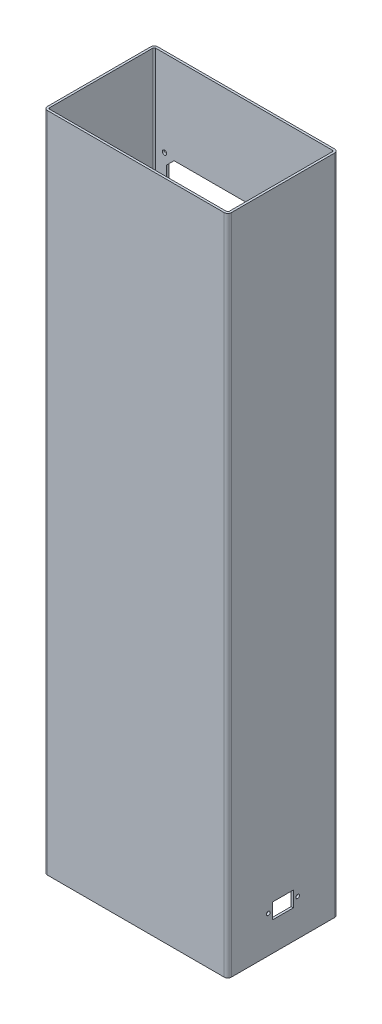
ISO-10303-21;
HEADER;
FILE_DESCRIPTION(('STEP AP214'),'2;1');
FILE_NAME('part.step','',(''),(''),'','','');
FILE_SCHEMA(('AUTOMOTIVE_DESIGN { 1 0 10303 214 1 1 1 1 }'));
ENDSEC;
DATA;
#1=APPLICATION_CONTEXT('core data for automotive mechanical design processes');
#2=APPLICATION_PROTOCOL_DEFINITION('international standard','automotive_design',2000,#1);
#3=PRODUCT_CONTEXT('',#1,'mechanical');
#4=PRODUCT('Part','Part','',(#3));
#5=PRODUCT_RELATED_PRODUCT_CATEGORY('part','',(#4));
#6=PRODUCT_DEFINITION_FORMATION('','',#4);
#7=PRODUCT_DEFINITION_CONTEXT('part definition',#1,'design');
#8=PRODUCT_DEFINITION('design','',#6,#7);
#9=PRODUCT_DEFINITION_SHAPE('','',#8);
#10=(LENGTH_UNIT() NAMED_UNIT(*) SI_UNIT(.MILLI.,.METRE.));
#11=(NAMED_UNIT(*) PLANE_ANGLE_UNIT() SI_UNIT($,.RADIAN.));
#12=(NAMED_UNIT(*) SI_UNIT($,.STERADIAN.) SOLID_ANGLE_UNIT());
#13=UNCERTAINTY_MEASURE_WITH_UNIT(LENGTH_MEASURE(1.E-05),#10,'distance_accuracy_value','');
#14=(GEOMETRIC_REPRESENTATION_CONTEXT(3) GLOBAL_UNCERTAINTY_ASSIGNED_CONTEXT((#13)) GLOBAL_UNIT_ASSIGNED_CONTEXT((#10,
#11,#12)) REPRESENTATION_CONTEXT('',''));
#15=CARTESIAN_POINT('',(0.,0.,0.));
#16=DIRECTION('',(0.,0.,1.));
#17=DIRECTION('',(1.,0.,0.));
#18=AXIS2_PLACEMENT_3D('',#15,#16,#17);
#19=CARTESIAN_POINT('',(1.59872115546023E-11,899.999999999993,-149.999999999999));
#20=DIRECTION('',(0.,-1.,0.));
#21=DIRECTION('',(0.,0.,-1.));
#22=AXIS2_PLACEMENT_3D('',#19,#20,#21);
#23=PLANE('',#22);
#24=DIRECTION('',(-1.,0.,0.));
#25=VECTOR('',#24,1.);
#26=CARTESIAN_POINT('',(1.59872115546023E-11,899.999999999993,-149.999999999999));
#27=LINE('',#26,#25);
#28=CARTESIAN_POINT('',(245.000000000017,899.999999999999,-149.999999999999));
#29=VERTEX_POINT('',#28);
#30=CARTESIAN_POINT('',(5.00000000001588,899.999999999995,-149.999999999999));
#31=VERTEX_POINT('',#30);
#32=EDGE_CURVE('E372',#29,#31,#27,.T.);
#33=ORIENTED_EDGE('',*,*,#32,.T.);
#34=CARTESIAN_POINT('',(5.00000000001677,899.999999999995,-144.999999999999));
#35=DIRECTION('',(0.,-1.,0.));
#36=DIRECTION('',(0.,0.,-1.));
#37=AXIS2_PLACEMENT_3D('',#34,#35,#36);
#38=CIRCLE('',#37,5.);
#39=CARTESIAN_POINT('',(1.68753899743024E-11,899.999999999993,-144.999999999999));
#40=VERTEX_POINT('',#39);
#41=EDGE_CURVE('E399',#31,#40,#38,.F.);
#42=ORIENTED_EDGE('',*,*,#41,.T.);
#43=DIRECTION('',(0.,0.,1.));
#44=VECTOR('',#43,1.);
#45=CARTESIAN_POINT('',(1.59872115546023E-11,899.999999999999,0.));
#46=LINE('',#45,#44);
#47=CARTESIAN_POINT('',(1.59872115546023E-11,899.999999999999,-4.99999999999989));
#48=VERTEX_POINT('',#47);
#49=EDGE_CURVE('E363',#40,#48,#46,.T.);
#50=ORIENTED_EDGE('',*,*,#49,.T.);
#51=CARTESIAN_POINT('',(5.00000000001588,900.000000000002,-4.99999999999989));
#52=DIRECTION('',(0.,-1.,0.));
#53=DIRECTION('',(0.,0.,-1.));
#54=AXIS2_PLACEMENT_3D('',#51,#52,#53);
#55=CIRCLE('',#54,5.);
#56=CARTESIAN_POINT('',(5.00000000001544,900.000000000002,0.));
#57=VERTEX_POINT('',#56);
#58=EDGE_CURVE('E397',#48,#57,#55,.F.);
#59=ORIENTED_EDGE('',*,*,#58,.T.);
#60=DIRECTION('',(1.,0.,0.));
#61=VECTOR('',#60,1.);
#62=CARTESIAN_POINT('',(1.59872115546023E-11,899.999999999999,0.));
#63=LINE('',#62,#61);
#64=CARTESIAN_POINT('',(245.000000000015,899.999999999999,0.));
#65=VERTEX_POINT('',#64);
#66=EDGE_CURVE('E366',#57,#65,#63,.T.);
#67=ORIENTED_EDGE('',*,*,#66,.T.);
#68=CARTESIAN_POINT('',(245.000000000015,899.999999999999,-4.99999999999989));
#69=DIRECTION('',(0.,-1.,0.));
#70=DIRECTION('',(0.,0.,-1.));
#71=AXIS2_PLACEMENT_3D('',#68,#69,#70);
#72=CIRCLE('',#71,5.);
#73=CARTESIAN_POINT('',(250.000000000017,900.,-4.99999999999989));
#74=VERTEX_POINT('',#73);
#75=EDGE_CURVE('E393',#65,#74,#72,.F.);
#76=ORIENTED_EDGE('',*,*,#75,.T.);
#77=DIRECTION('',(0.,0.,-1.));
#78=VECTOR('',#77,1.);
#79=CARTESIAN_POINT('',(250.000000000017,900.,6.66133814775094E-13));
#80=LINE('',#79,#78);
#81=CARTESIAN_POINT('',(250.000000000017,900.,-145.));
#82=VERTEX_POINT('',#81);
#83=EDGE_CURVE('E369',#74,#82,#80,.T.);
#84=ORIENTED_EDGE('',*,*,#83,.T.);
#85=CARTESIAN_POINT('',(245.000000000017,899.999999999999,-144.999999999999));
#86=DIRECTION('',(0.,-1.,0.));
#87=DIRECTION('',(0.,0.,-1.));
#88=AXIS2_PLACEMENT_3D('',#85,#86,#87);
#89=CIRCLE('',#88,5.);
#90=EDGE_CURVE('E395',#82,#29,#89,.F.);
#91=ORIENTED_EDGE('',*,*,#90,.T.);
#92=EDGE_LOOP('',(#33,#42,#50,#59,#67,#76,#84,#91));
#93=FACE_BOUND('',#92,.T.);
#94=DIRECTION('',(-1.,0.,0.));
#95=VECTOR('',#94,1.);
#96=CARTESIAN_POINT('',(1.68753899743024E-11,899.999999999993,-146.999999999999));
#97=LINE('',#96,#95);
#98=CARTESIAN_POINT('',(245.000000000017,899.999999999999,-146.999999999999));
#99=VERTEX_POINT('',#98);
#100=CARTESIAN_POINT('',(5.00000000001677,899.999999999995,-146.999999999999));
#101=VERTEX_POINT('',#100);
#102=EDGE_CURVE('E300',#99,#101,#97,.T.);
#103=ORIENTED_EDGE('',*,*,#102,.F.);
#104=CARTESIAN_POINT('',(245.000000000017,899.999999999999,-144.999999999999));
#105=DIRECTION('',(0.,-1.,0.));
#106=DIRECTION('',(0.,0.,-1.));
#107=AXIS2_PLACEMENT_3D('',#104,#105,#106);
#108=CIRCLE('',#107,2.);
#109=CARTESIAN_POINT('',(247.000000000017,900.000000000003,-144.999999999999));
#110=VERTEX_POINT('',#109);
#111=EDGE_CURVE('E326',#110,#99,#108,.F.);
#112=ORIENTED_EDGE('',*,*,#111,.F.);
#113=DIRECTION('',(0.,0.,-1.));
#114=VECTOR('',#113,1.);
#115=CARTESIAN_POINT('',(247.000000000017,900.000000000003,-149.999999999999));
#116=LINE('',#115,#114);
#117=CARTESIAN_POINT('',(247.000000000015,900.000000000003,-4.99999999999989));
#118=VERTEX_POINT('',#117);
#119=EDGE_CURVE('E329',#118,#110,#116,.T.);
#120=ORIENTED_EDGE('',*,*,#119,.F.);
#121=CARTESIAN_POINT('',(245.000000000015,899.999999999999,-4.99999999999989));
#122=DIRECTION('',(0.,-1.,0.));
#123=DIRECTION('',(0.,0.,-1.));
#124=AXIS2_PLACEMENT_3D('',#121,#122,#123);
#125=CIRCLE('',#124,2.);
#126=CARTESIAN_POINT('',(245.000000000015,899.999999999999,-3.00000000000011));
#127=VERTEX_POINT('',#126);
#128=EDGE_CURVE('E303',#127,#118,#125,.F.);
#129=ORIENTED_EDGE('',*,*,#128,.F.);
#130=DIRECTION('',(1.,0.,0.));
#131=VECTOR('',#130,1.);
#132=CARTESIAN_POINT('',(1.59872115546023E-11,899.999999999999,-3.00000000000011));
#133=LINE('',#132,#131);
#134=CARTESIAN_POINT('',(5.00000000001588,900.000000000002,-3.00000000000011));
#135=VERTEX_POINT('',#134);
#136=EDGE_CURVE('E322',#135,#127,#133,.T.);
#137=ORIENTED_EDGE('',*,*,#136,.F.);
#138=CARTESIAN_POINT('',(5.00000000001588,900.000000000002,-4.99999999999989));
#139=DIRECTION('',(0.,-1.,0.));
#140=DIRECTION('',(0.,0.,-1.));
#141=AXIS2_PLACEMENT_3D('',#138,#139,#140);
#142=CIRCLE('',#141,2.);
#143=CARTESIAN_POINT('',(3.00000000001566,899.999999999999,-4.99999999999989));
#144=VERTEX_POINT('',#143);
#145=EDGE_CURVE('E324',#144,#135,#142,.F.);
#146=ORIENTED_EDGE('',*,*,#145,.F.);
#147=DIRECTION('',(0.,0.,1.));
#148=VECTOR('',#147,1.);
#149=CARTESIAN_POINT('',(3.00000000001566,899.999999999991,-149.999999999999));
#150=LINE('',#149,#148);
#151=CARTESIAN_POINT('',(3.00000000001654,899.999999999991,-144.999999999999));
#152=VERTEX_POINT('',#151);
#153=EDGE_CURVE('E319',#152,#144,#150,.T.);
#154=ORIENTED_EDGE('',*,*,#153,.F.);
#155=CARTESIAN_POINT('',(5.00000000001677,899.999999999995,-144.999999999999));
#156=DIRECTION('',(0.,-1.,0.));
#157=DIRECTION('',(0.,0.,-1.));
#158=AXIS2_PLACEMENT_3D('',#155,#156,#157);
#159=CIRCLE('',#158,2.);
#160=EDGE_CURVE('E316',#101,#152,#159,.F.);
#161=ORIENTED_EDGE('',*,*,#160,.F.);
#162=EDGE_LOOP('',(#103,#112,#120,#129,#137,#146,#154,#161));
#163=FACE_BOUND('',#162,.T.);
#164=ADVANCED_FACE('F24',(#93,#163),#23,.F.);
#165=CARTESIAN_POINT('',(2.22044604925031E-12,0.,-149.999999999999));
#166=DIRECTION('',(0.,-1.,0.));
#167=DIRECTION('',(0.,0.,-1.));
#168=AXIS2_PLACEMENT_3D('',#165,#166,#167);
#169=PLANE('',#168);
#170=DIRECTION('',(0.,0.,1.));
#171=VECTOR('',#170,1.);
#172=CARTESIAN_POINT('',(0.,2.22044604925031E-13,0.));
#173=LINE('',#172,#171);
#174=CARTESIAN_POINT('',(-1.77635683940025E-12,0.,-144.999999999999));
#175=VERTEX_POINT('',#174);
#176=CARTESIAN_POINT('',(-8.88178419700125E-13,2.22044604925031E-13,-4.99999999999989));
#177=VERTEX_POINT('',#176);
#178=EDGE_CURVE('E310',#175,#177,#173,.T.);
#179=ORIENTED_EDGE('',*,*,#178,.F.);
#180=CARTESIAN_POINT('',(4.99999999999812,2.66453525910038E-12,-144.999999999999));
#181=DIRECTION('',(0.,-1.,0.));
#182=DIRECTION('',(0.,0.,-1.));
#183=AXIS2_PLACEMENT_3D('',#180,#181,#182);
#184=CIRCLE('',#183,5.);
#185=CARTESIAN_POINT('',(5.00000000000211,2.66453525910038E-12,-149.999999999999));
#186=VERTEX_POINT('',#185);
#187=EDGE_CURVE('E386',#175,#186,#184,.T.);
#188=ORIENTED_EDGE('',*,*,#187,.T.);
#189=DIRECTION('',(-1.,0.,0.));
#190=VECTOR('',#189,1.);
#191=CARTESIAN_POINT('',(2.22044604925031E-12,0.,-149.999999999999));
#192=LINE('',#191,#190);
#193=CARTESIAN_POINT('',(245.000000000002,-5.55111512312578E-13,-149.999999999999));
#194=VERTEX_POINT('',#193);
#195=EDGE_CURVE('E360',#194,#186,#192,.T.);
#196=ORIENTED_EDGE('',*,*,#195,.F.);
#197=CARTESIAN_POINT('',(244.999999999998,-5.55111512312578E-13,-144.999999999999));
#198=DIRECTION('',(0.,-1.,0.));
#199=DIRECTION('',(0.,0.,-1.));
#200=AXIS2_PLACEMENT_3D('',#197,#198,#199);
#201=CIRCLE('',#200,5.);
#202=CARTESIAN_POINT('',(249.999999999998,3.33066907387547E-13,-145.));
#203=VERTEX_POINT('',#202);
#204=EDGE_CURVE('E382',#194,#203,#201,.T.);
#205=ORIENTED_EDGE('',*,*,#204,.T.);
#206=DIRECTION('',(0.,0.,-1.));
#207=VECTOR('',#206,1.);
#208=CARTESIAN_POINT('',(250.,5.55111512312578E-13,4.44089209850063E-13));
#209=LINE('',#208,#207);
#210=CARTESIAN_POINT('',(249.999999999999,5.55111512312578E-13,-4.99999999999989));
#211=VERTEX_POINT('',#210);
#212=EDGE_CURVE('E357',#211,#203,#209,.T.);
#213=ORIENTED_EDGE('',*,*,#212,.F.);
#214=CARTESIAN_POINT('',(244.999999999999,-5.55111512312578E-13,-4.99999999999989));
#215=DIRECTION('',(0.,-1.,0.));
#216=DIRECTION('',(0.,0.,-1.));
#217=AXIS2_PLACEMENT_3D('',#214,#215,#216);
#218=CIRCLE('',#217,5.);
#219=CARTESIAN_POINT('',(245.,-5.55111512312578E-13,0.));
#220=VERTEX_POINT('',#219);
#221=EDGE_CURVE('E380',#211,#220,#218,.T.);
#222=ORIENTED_EDGE('',*,*,#221,.T.);
#223=DIRECTION('',(1.,0.,0.));
#224=VECTOR('',#223,1.);
#225=CARTESIAN_POINT('',(0.,2.22044604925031E-13,0.));
#226=LINE('',#225,#224);
#227=CARTESIAN_POINT('',(4.99999999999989,2.66453525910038E-12,0.));
#228=VERTEX_POINT('',#227);
#229=EDGE_CURVE('E354',#228,#220,#226,.T.);
#230=ORIENTED_EDGE('',*,*,#229,.F.);
#231=CARTESIAN_POINT('',(4.99999999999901,2.66453525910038E-12,-4.99999999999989));
#232=DIRECTION('',(0.,-1.,0.));
#233=DIRECTION('',(0.,0.,-1.));
#234=AXIS2_PLACEMENT_3D('',#231,#232,#233);
#235=CIRCLE('',#234,5.);
#236=EDGE_CURVE('E384',#228,#177,#235,.T.);
#237=ORIENTED_EDGE('',*,*,#236,.T.);
#238=EDGE_LOOP('',(#179,#188,#196,#205,#213,#222,#230,#237));
#239=FACE_BOUND('',#238,.T.);
#240=CARTESIAN_POINT('',(4.99999999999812,2.66453525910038E-12,-144.999999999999));
#241=DIRECTION('',(0.,-1.,0.));
#242=DIRECTION('',(0.,0.,-1.));
#243=AXIS2_PLACEMENT_3D('',#240,#241,#242);
#244=CIRCLE('',#243,2.);
#245=CARTESIAN_POINT('',(2.99999999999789,-9.57567358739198E-13,-144.999999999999));
#246=VERTEX_POINT('',#245);
#247=CARTESIAN_POINT('',(4.99999999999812,2.66453525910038E-12,-146.999999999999));
#248=VERTEX_POINT('',#247);
#249=EDGE_CURVE('E306',#246,#248,#244,.T.);
#250=ORIENTED_EDGE('',*,*,#249,.F.);
#251=DIRECTION('',(0.,0.,1.));
#252=VECTOR('',#251,1.);
#253=CARTESIAN_POINT('',(3.00000000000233,-9.57567358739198E-13,-149.999999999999));
#254=LINE('',#253,#252);
#255=CARTESIAN_POINT('',(2.99999999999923,-9.57567358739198E-13,-4.99999999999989));
#256=VERTEX_POINT('',#255);
#257=EDGE_CURVE('E280',#246,#256,#254,.T.);
#258=ORIENTED_EDGE('',*,*,#257,.T.);
#259=CARTESIAN_POINT('',(4.99999999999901,2.66453525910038E-12,-4.99999999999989));
#260=DIRECTION('',(0.,-1.,0.));
#261=DIRECTION('',(0.,0.,-1.));
#262=AXIS2_PLACEMENT_3D('',#259,#260,#261);
#263=CIRCLE('',#262,2.);
#264=CARTESIAN_POINT('',(5.00000000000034,2.66453525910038E-12,-3.00000000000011));
#265=VERTEX_POINT('',#264);
#266=EDGE_CURVE('E340',#265,#256,#263,.T.);
#267=ORIENTED_EDGE('',*,*,#266,.F.);
#268=DIRECTION('',(1.,0.,0.));
#269=VECTOR('',#268,1.);
#270=CARTESIAN_POINT('',(0.,2.22044604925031E-13,-3.00000000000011));
#271=LINE('',#270,#269);
#272=CARTESIAN_POINT('',(245.,-5.55111512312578E-13,-3.00000000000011));
#273=VERTEX_POINT('',#272);
#274=EDGE_CURVE('E338',#265,#273,#271,.T.);
#275=ORIENTED_EDGE('',*,*,#274,.T.);
#276=CARTESIAN_POINT('',(244.999999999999,-5.55111512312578E-13,-4.99999999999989));
#277=DIRECTION('',(0.,-1.,0.));
#278=DIRECTION('',(0.,0.,-1.));
#279=AXIS2_PLACEMENT_3D('',#276,#277,#278);
#280=CIRCLE('',#279,2.);
#281=CARTESIAN_POINT('',(246.999999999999,3.01147995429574E-12,-4.99999999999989));
#282=VERTEX_POINT('',#281);
#283=EDGE_CURVE('E297',#282,#273,#280,.T.);
#284=ORIENTED_EDGE('',*,*,#283,.F.);
#285=DIRECTION('',(0.,0.,-1.));
#286=VECTOR('',#285,1.);
#287=CARTESIAN_POINT('',(247.000000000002,3.01147995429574E-12,-149.999999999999));
#288=LINE('',#287,#286);
#289=CARTESIAN_POINT('',(246.999999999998,3.01147995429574E-12,-144.999999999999));
#290=VERTEX_POINT('',#289);
#291=EDGE_CURVE('E343',#282,#290,#288,.T.);
#292=ORIENTED_EDGE('',*,*,#291,.T.);
#293=CARTESIAN_POINT('',(244.999999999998,-5.55111512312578E-13,-144.999999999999));
#294=DIRECTION('',(0.,-1.,0.));
#295=DIRECTION('',(0.,0.,-1.));
#296=AXIS2_PLACEMENT_3D('',#293,#294,#295);
#297=CIRCLE('',#296,2.);
#298=CARTESIAN_POINT('',(244.999999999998,-5.55111512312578E-13,-146.999999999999));
#299=VERTEX_POINT('',#298);
#300=EDGE_CURVE('E344',#299,#290,#297,.T.);
#301=ORIENTED_EDGE('',*,*,#300,.F.);
#302=DIRECTION('',(-1.,0.,0.));
#303=VECTOR('',#302,1.);
#304=CARTESIAN_POINT('',(-2.22044604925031E-12,0.,-146.999999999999));
#305=LINE('',#304,#303);
#306=EDGE_CURVE('E323',#299,#248,#305,.T.);
#307=ORIENTED_EDGE('',*,*,#306,.T.);
#308=EDGE_LOOP('',(#250,#258,#267,#275,#284,#292,#301,#307));
#309=FACE_BOUND('',#308,.T.);
#310=ADVANCED_FACE('F470',(#239,#309),#169,.T.);
#311=CARTESIAN_POINT('',(1.59872115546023E-11,899.999999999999,0.));
#312=DIRECTION('',(1.,0.,0.));
#313=DIRECTION('',(0.,0.,-1.));
#314=AXIS2_PLACEMENT_3D('',#311,#312,#313);
#315=PLANE('',#314);
#316=ORIENTED_EDGE('',*,*,#49,.F.);
#317=DIRECTION('',(0.,-1.,0.));
#318=VECTOR('',#317,1.);
#319=CARTESIAN_POINT('',(1.68753899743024E-11,899.999999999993,-144.999999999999));
#320=LINE('',#319,#318);
#321=EDGE_CURVE('E377',#40,#175,#320,.T.);
#322=ORIENTED_EDGE('',*,*,#321,.T.);
#323=ORIENTED_EDGE('',*,*,#178,.T.);
#324=DIRECTION('',(0.,-1.,0.));
#325=VECTOR('',#324,1.);
#326=CARTESIAN_POINT('',(1.59872115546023E-11,899.999999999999,-4.99999999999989));
#327=LINE('',#326,#325);
#328=EDGE_CURVE('E375',#177,#48,#327,.F.);
#329=ORIENTED_EDGE('',*,*,#328,.T.);
#330=EDGE_LOOP('',(#316,#322,#323,#329));
#331=FACE_BOUND('',#330,.T.);
#332=ADVANCED_FACE('F26',(#331),#315,.F.);
#333=CARTESIAN_POINT('',(1.59872115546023E-11,899.999999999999,0.));
#334=DIRECTION('',(0.,0.,-1.));
#335=DIRECTION('',(-1.,0.,0.));
#336=AXIS2_PLACEMENT_3D('',#333,#334,#335);
#337=PLANE('',#336);
#338=ORIENTED_EDGE('',*,*,#66,.F.);
#339=DIRECTION('',(0.,-1.,0.));
#340=VECTOR('',#339,1.);
#341=CARTESIAN_POINT('',(5.00000000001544,900.000000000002,0.));
#342=LINE('',#341,#340);
#343=EDGE_CURVE('E403',#57,#228,#342,.T.);
#344=ORIENTED_EDGE('',*,*,#343,.T.);
#345=ORIENTED_EDGE('',*,*,#229,.T.);
#346=DIRECTION('',(0.,-1.,0.));
#347=VECTOR('',#346,1.);
#348=CARTESIAN_POINT('',(245.000000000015,899.999999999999,0.));
#349=LINE('',#348,#347);
#350=EDGE_CURVE('E401',#220,#65,#349,.F.);
#351=ORIENTED_EDGE('',*,*,#350,.T.);
#352=EDGE_LOOP('',(#338,#344,#345,#351));
#353=FACE_BOUND('',#352,.T.);
#354=ADVANCED_FACE('F459',(#353),#337,.F.);
#355=CARTESIAN_POINT('',(250.000000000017,900.,6.66133814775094E-13));
#356=DIRECTION('',(-1.,0.,0.));
#357=DIRECTION('',(0.,0.,1.));
#358=AXIS2_PLACEMENT_3D('',#355,#356,#357);
#359=PLANE('',#358);
#360=CARTESIAN_POINT('',(250.00000000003,50.0000000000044,-54.9999999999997));
#361=DIRECTION('',(1.,0.,0.));
#362=DIRECTION('',(0.,1.,0.));
#363=AXIS2_PLACEMENT_3D('',#360,#361,#362);
#364=CIRCLE('',#363,2.5);
#365=CARTESIAN_POINT('',(250.00000000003,52.5000000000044,-54.9999999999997));
#366=VERTEX_POINT('',#365);
#367=EDGE_CURVE('E449',#366,#366,#364,.T.);
#368=ORIENTED_EDGE('',*,*,#367,.F.);
#369=EDGE_LOOP('',(#368));
#370=FACE_BOUND('',#369,.T.);
#371=CARTESIAN_POINT('',(250.00000000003,50.0000000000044,-94.9999999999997));
#372=DIRECTION('',(1.,0.,0.));
#373=DIRECTION('',(0.,1.,0.));
#374=AXIS2_PLACEMENT_3D('',#371,#372,#373);
#375=CIRCLE('',#374,2.49999999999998);
#376=CARTESIAN_POINT('',(250.00000000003,52.5000000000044,-94.9999999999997));
#377=VERTEX_POINT('',#376);
#378=EDGE_CURVE('E441',#377,#377,#375,.T.);
#379=ORIENTED_EDGE('',*,*,#378,.F.);
#380=EDGE_LOOP('',(#379));
#381=FACE_BOUND('',#380,.T.);
#382=DIRECTION('',(0.,0.,-1.));
#383=VECTOR('',#382,1.);
#384=CARTESIAN_POINT('',(250.000000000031,39.5000000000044,-60.9999999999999));
#385=LINE('',#384,#383);
#386=CARTESIAN_POINT('',(250.000000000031,39.5000000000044,-60.9999999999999));
#387=VERTEX_POINT('',#386);
#388=CARTESIAN_POINT('',(250.000000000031,39.5000000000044,-88.9999999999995));
#389=VERTEX_POINT('',#388);
#390=EDGE_CURVE('E222',#387,#389,#385,.T.);
#391=ORIENTED_EDGE('',*,*,#390,.F.);
#392=DIRECTION('',(0.,-1.,0.));
#393=VECTOR('',#392,1.);
#394=CARTESIAN_POINT('',(250.00000000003,60.5000000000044,-60.9999999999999));
#395=LINE('',#394,#393);
#396=CARTESIAN_POINT('',(250.00000000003,60.5000000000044,-60.9999999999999));
#397=VERTEX_POINT('',#396);
#398=EDGE_CURVE('E41',#397,#387,#395,.T.);
#399=ORIENTED_EDGE('',*,*,#398,.F.);
#400=DIRECTION('',(0.,0.,1.));
#401=VECTOR('',#400,1.);
#402=CARTESIAN_POINT('',(250.00000000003,60.5000000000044,-60.9999999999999));
#403=LINE('',#402,#401);
#404=CARTESIAN_POINT('',(250.000000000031,60.5000000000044,-88.9999999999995));
#405=VERTEX_POINT('',#404);
#406=EDGE_CURVE('E229',#405,#397,#403,.T.);
#407=ORIENTED_EDGE('',*,*,#406,.F.);
#408=DIRECTION('',(0.,1.,0.));
#409=VECTOR('',#408,1.);
#410=CARTESIAN_POINT('',(250.000000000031,60.5000000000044,-88.9999999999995));
#411=LINE('',#410,#409);
#412=EDGE_CURVE('E213',#389,#405,#411,.T.);
#413=ORIENTED_EDGE('',*,*,#412,.F.);
#414=EDGE_LOOP('',(#391,#399,#407,#413));
#415=FACE_BOUND('',#414,.T.);
#416=ORIENTED_EDGE('',*,*,#212,.T.);
#417=DIRECTION('',(0.,-1.,0.));
#418=VECTOR('',#417,1.);
#419=CARTESIAN_POINT('',(250.000000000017,900.,-145.));
#420=LINE('',#419,#418);
#421=EDGE_CURVE('E409',#203,#82,#420,.F.);
#422=ORIENTED_EDGE('',*,*,#421,.T.);
#423=ORIENTED_EDGE('',*,*,#83,.F.);
#424=DIRECTION('',(0.,-1.,0.));
#425=VECTOR('',#424,1.);
#426=CARTESIAN_POINT('',(250.000000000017,900.,-4.99999999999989));
#427=LINE('',#426,#425);
#428=EDGE_CURVE('E406',#74,#211,#427,.T.);
#429=ORIENTED_EDGE('',*,*,#428,.T.);
#430=EDGE_LOOP('',(#416,#422,#423,#429));
#431=FACE_BOUND('',#430,.T.);
#432=ADVANCED_FACE('F226',(#370,#381,#415,#431),#359,.F.);
#433=CARTESIAN_POINT('',(1.59872115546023E-11,899.999999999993,-149.999999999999));
#434=DIRECTION('',(0.,0.,1.));
#435=DIRECTION('',(1.,0.,0.));
#436=AXIS2_PLACEMENT_3D('',#433,#434,#435);
#437=PLANE('',#436);
#438=CARTESIAN_POINT('',(233.,447.,-149.999999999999));
#439=DIRECTION('',(0.,0.,-1.));
#440=DIRECTION('',(0.,1.,0.));
#441=AXIS2_PLACEMENT_3D('',#438,#439,#440);
#442=CIRCLE('',#441,2.99999999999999);
#443=CARTESIAN_POINT('',(233.,450.,-149.999999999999));
#444=VERTEX_POINT('',#443);
#445=EDGE_CURVE('E236',#444,#444,#442,.T.);
#446=ORIENTED_EDGE('',*,*,#445,.F.);
#447=EDGE_LOOP('',(#446));
#448=FACE_BOUND('',#447,.T.);
#449=CARTESIAN_POINT('',(233.,783.,-149.999999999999));
#450=DIRECTION('',(0.,0.,-1.));
#451=DIRECTION('',(0.,1.,0.));
#452=AXIS2_PLACEMENT_3D('',#449,#450,#451);
#453=CIRCLE('',#452,2.99999999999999);
#454=CARTESIAN_POINT('',(233.,786.,-149.999999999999));
#455=VERTEX_POINT('',#454);
#456=EDGE_CURVE('E242',#455,#455,#453,.T.);
#457=ORIENTED_EDGE('',*,*,#456,.F.);
#458=EDGE_LOOP('',(#457));
#459=FACE_BOUND('',#458,.T.);
#460=CARTESIAN_POINT('',(17.0000000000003,447.,-149.999999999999));
#461=DIRECTION('',(0.,0.,-1.));
#462=DIRECTION('',(0.,1.,0.));
#463=AXIS2_PLACEMENT_3D('',#460,#461,#462);
#464=CIRCLE('',#463,3.);
#465=CARTESIAN_POINT('',(17.0000000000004,450.,-149.999999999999));
#466=VERTEX_POINT('',#465);
#467=EDGE_CURVE('E246',#466,#466,#464,.T.);
#468=ORIENTED_EDGE('',*,*,#467,.F.);
#469=EDGE_LOOP('',(#468));
#470=FACE_BOUND('',#469,.T.);
#471=CARTESIAN_POINT('',(17.0000000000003,783.000000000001,-149.999999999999));
#472=DIRECTION('',(0.,0.,-1.));
#473=DIRECTION('',(0.,1.,0.));
#474=AXIS2_PLACEMENT_3D('',#471,#472,#473);
#475=CIRCLE('',#474,3.);
#476=CARTESIAN_POINT('',(17.0000000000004,786.000000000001,-149.999999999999));
#477=VERTEX_POINT('',#476);
#478=EDGE_CURVE('E250',#477,#477,#475,.T.);
#479=ORIENTED_EDGE('',*,*,#478,.F.);
#480=EDGE_LOOP('',(#479));
#481=FACE_BOUND('',#480,.T.);
#482=DIRECTION('',(-0.707106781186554,-0.707106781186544,0.));
#483=VECTOR('',#482,1.);
#484=CARTESIAN_POINT('',(220.,450.,-149.999999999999));
#485=LINE('',#484,#483);
#486=CARTESIAN_POINT('',(230.000000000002,460.,-149.999999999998));
#487=VERTEX_POINT('',#486);
#488=CARTESIAN_POINT('',(220.,450.,-149.999999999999));
#489=VERTEX_POINT('',#488);
#490=EDGE_CURVE('E256',#487,#489,#485,.T.);
#491=ORIENTED_EDGE('',*,*,#490,.F.);
#492=DIRECTION('',(0.,-1.,0.));
#493=VECTOR('',#492,1.);
#494=CARTESIAN_POINT('',(230.,770.,-149.999999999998));
#495=LINE('',#494,#493);
#496=CARTESIAN_POINT('',(230.,770.,-149.999999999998));
#497=VERTEX_POINT('',#496);
#498=EDGE_CURVE('E254',#497,#487,#495,.T.);
#499=ORIENTED_EDGE('',*,*,#498,.F.);
#500=DIRECTION('',(0.707106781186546,-0.707106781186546,0.));
#501=VECTOR('',#500,1.);
#502=CARTESIAN_POINT('',(230.,770.,-149.999999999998));
#503=LINE('',#502,#501);
#504=CARTESIAN_POINT('',(220.,780.000000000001,-149.999999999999));
#505=VERTEX_POINT('',#504);
#506=EDGE_CURVE('E274',#505,#497,#503,.T.);
#507=ORIENTED_EDGE('',*,*,#506,.F.);
#508=DIRECTION('',(1.,0.,0.));
#509=VECTOR('',#508,1.);
#510=CARTESIAN_POINT('',(220.,780.000000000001,-149.999999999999));
#511=LINE('',#510,#509);
#512=CARTESIAN_POINT('',(30.0000000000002,780.,-149.999999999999));
#513=VERTEX_POINT('',#512);
#514=EDGE_CURVE('E271',#513,#505,#511,.T.);
#515=ORIENTED_EDGE('',*,*,#514,.F.);
#516=DIRECTION('',(0.707106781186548,0.70710678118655,0.));
#517=VECTOR('',#516,1.);
#518=CARTESIAN_POINT('',(30.0000000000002,780.,-149.999999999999));
#519=LINE('',#518,#517);
#520=CARTESIAN_POINT('',(20.0000000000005,770.,-150.));
#521=VERTEX_POINT('',#520);
#522=EDGE_CURVE('E268',#521,#513,#519,.T.);
#523=ORIENTED_EDGE('',*,*,#522,.F.);
#524=DIRECTION('',(0.,1.,0.));
#525=VECTOR('',#524,1.);
#526=CARTESIAN_POINT('',(20.0000000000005,770.,-150.));
#527=LINE('',#526,#525);
#528=CARTESIAN_POINT('',(20.0000000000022,460.,-150.));
#529=VERTEX_POINT('',#528);
#530=EDGE_CURVE('E265',#529,#521,#527,.T.);
#531=ORIENTED_EDGE('',*,*,#530,.F.);
#532=DIRECTION('',(-0.707106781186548,0.707106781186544,0.));
#533=VECTOR('',#532,1.);
#534=CARTESIAN_POINT('',(20.0000000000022,460.,-150.));
#535=LINE('',#534,#533);
#536=CARTESIAN_POINT('',(30.0000000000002,450.,-149.999999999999));
#537=VERTEX_POINT('',#536);
#538=EDGE_CURVE('E262',#537,#529,#535,.T.);
#539=ORIENTED_EDGE('',*,*,#538,.F.);
#540=DIRECTION('',(-1.,0.,0.));
#541=VECTOR('',#540,1.);
#542=CARTESIAN_POINT('',(220.,450.,-149.999999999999));
#543=LINE('',#542,#541);
#544=EDGE_CURVE('E259',#489,#537,#543,.T.);
#545=ORIENTED_EDGE('',*,*,#544,.F.);
#546=EDGE_LOOP('',(#491,#499,#507,#515,#523,#531,#539,#545));
#547=FACE_BOUND('',#546,.T.);
#548=ORIENTED_EDGE('',*,*,#195,.T.);
#549=DIRECTION('',(0.,-1.,0.));
#550=VECTOR('',#549,1.);
#551=CARTESIAN_POINT('',(5.00000000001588,899.999999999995,-149.999999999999));
#552=LINE('',#551,#550);
#553=EDGE_CURVE('E391',#186,#31,#552,.F.);
#554=ORIENTED_EDGE('',*,*,#553,.T.);
#555=ORIENTED_EDGE('',*,*,#32,.F.);
#556=DIRECTION('',(0.,-1.,0.));
#557=VECTOR('',#556,1.);
#558=CARTESIAN_POINT('',(245.000000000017,899.999999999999,-149.999999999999));
#559=LINE('',#558,#557);
#560=EDGE_CURVE('E388',#29,#194,#559,.T.);
#561=ORIENTED_EDGE('',*,*,#560,.T.);
#562=EDGE_LOOP('',(#548,#554,#555,#561));
#563=FACE_BOUND('',#562,.T.);
#564=ADVANCED_FACE('F458',(#448,#459,#470,#481,#547,#563),#437,.F.);
#565=CARTESIAN_POINT('',(5.00000000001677,899.999999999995,-144.999999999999));
#566=DIRECTION('',(0.,-1.,0.));
#567=DIRECTION('',(0.,0.,-1.));
#568=AXIS2_PLACEMENT_3D('',#565,#566,#567);
#569=CYLINDRICAL_SURFACE('',#568,5.);
#570=ORIENTED_EDGE('',*,*,#41,.F.);
#571=ORIENTED_EDGE('',*,*,#553,.F.);
#572=ORIENTED_EDGE('',*,*,#187,.F.);
#573=ORIENTED_EDGE('',*,*,#321,.F.);
#574=EDGE_LOOP('',(#570,#571,#572,#573));
#575=FACE_BOUND('',#574,.T.);
#576=ADVANCED_FACE('F465',(#575),#569,.T.);
#577=CARTESIAN_POINT('',(5.00000000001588,900.000000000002,-4.99999999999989));
#578=DIRECTION('',(0.,-1.,0.));
#579=DIRECTION('',(0.,0.,-1.));
#580=AXIS2_PLACEMENT_3D('',#577,#578,#579);
#581=CYLINDRICAL_SURFACE('',#580,5.);
#582=ORIENTED_EDGE('',*,*,#58,.F.);
#583=ORIENTED_EDGE('',*,*,#328,.F.);
#584=ORIENTED_EDGE('',*,*,#236,.F.);
#585=ORIENTED_EDGE('',*,*,#343,.F.);
#586=EDGE_LOOP('',(#582,#583,#584,#585));
#587=FACE_BOUND('',#586,.T.);
#588=ADVANCED_FACE('F482',(#587),#581,.T.);
#589=CARTESIAN_POINT('',(245.000000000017,899.999999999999,-144.999999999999));
#590=DIRECTION('',(0.,-1.,0.));
#591=DIRECTION('',(0.,0.,-1.));
#592=AXIS2_PLACEMENT_3D('',#589,#590,#591);
#593=CYLINDRICAL_SURFACE('',#592,5.);
#594=ORIENTED_EDGE('',*,*,#90,.F.);
#595=ORIENTED_EDGE('',*,*,#421,.F.);
#596=ORIENTED_EDGE('',*,*,#204,.F.);
#597=ORIENTED_EDGE('',*,*,#560,.F.);
#598=EDGE_LOOP('',(#594,#595,#596,#597));
#599=FACE_BOUND('',#598,.T.);
#600=ADVANCED_FACE('F486',(#599),#593,.T.);
#601=CARTESIAN_POINT('',(245.000000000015,899.999999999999,-4.99999999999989));
#602=DIRECTION('',(0.,-1.,0.));
#603=DIRECTION('',(0.,0.,-1.));
#604=AXIS2_PLACEMENT_3D('',#601,#602,#603);
#605=CYLINDRICAL_SURFACE('',#604,5.);
#606=ORIENTED_EDGE('',*,*,#75,.F.);
#607=ORIENTED_EDGE('',*,*,#350,.F.);
#608=ORIENTED_EDGE('',*,*,#221,.F.);
#609=ORIENTED_EDGE('',*,*,#428,.F.);
#610=EDGE_LOOP('',(#606,#607,#608,#609));
#611=FACE_BOUND('',#610,.T.);
#612=ADVANCED_FACE('F490',(#611),#605,.T.);
#613=CARTESIAN_POINT('',(3.00000000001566,899.999999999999,0.));
#614=DIRECTION('',(1.,0.,0.));
#615=DIRECTION('',(0.,0.,-1.));
#616=AXIS2_PLACEMENT_3D('',#613,#614,#615);
#617=PLANE('',#616);
#618=ORIENTED_EDGE('',*,*,#153,.T.);
#619=DIRECTION('',(0.,1.,0.));
#620=VECTOR('',#619,1.);
#621=CARTESIAN_POINT('',(3.00000000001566,899.999999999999,-4.99999999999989));
#622=LINE('',#621,#620);
#623=EDGE_CURVE('E298',#256,#144,#622,.T.);
#624=ORIENTED_EDGE('',*,*,#623,.F.);
#625=ORIENTED_EDGE('',*,*,#257,.F.);
#626=DIRECTION('',(0.,1.,0.));
#627=VECTOR('',#626,1.);
#628=CARTESIAN_POINT('',(3.00000000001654,899.999999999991,-144.999999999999));
#629=LINE('',#628,#627);
#630=EDGE_CURVE('E295',#152,#246,#629,.F.);
#631=ORIENTED_EDGE('',*,*,#630,.F.);
#632=EDGE_LOOP('',(#618,#624,#625,#631));
#633=FACE_BOUND('',#632,.T.);
#634=ADVANCED_FACE('F494',(#633),#617,.T.);
#635=CARTESIAN_POINT('',(1.59872115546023E-11,899.999999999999,-3.00000000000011));
#636=DIRECTION('',(0.,0.,-1.));
#637=DIRECTION('',(-1.,0.,0.));
#638=AXIS2_PLACEMENT_3D('',#635,#636,#637);
#639=PLANE('',#638);
#640=ORIENTED_EDGE('',*,*,#136,.T.);
#641=DIRECTION('',(0.,1.,0.));
#642=VECTOR('',#641,1.);
#643=CARTESIAN_POINT('',(245.000000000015,899.999999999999,-3.00000000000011));
#644=LINE('',#643,#642);
#645=EDGE_CURVE('E314',#273,#127,#644,.T.);
#646=ORIENTED_EDGE('',*,*,#645,.F.);
#647=ORIENTED_EDGE('',*,*,#274,.F.);
#648=DIRECTION('',(0.,1.,0.));
#649=VECTOR('',#648,1.);
#650=CARTESIAN_POINT('',(5.00000000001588,900.000000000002,-3.00000000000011));
#651=LINE('',#650,#649);
#652=EDGE_CURVE('E313',#135,#265,#651,.F.);
#653=ORIENTED_EDGE('',*,*,#652,.F.);
#654=EDGE_LOOP('',(#640,#646,#647,#653));
#655=FACE_BOUND('',#654,.T.);
#656=ADVANCED_FACE('F520',(#655),#639,.T.);
#657=CARTESIAN_POINT('',(247.000000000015,900.000000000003,0.));
#658=DIRECTION('',(-1.,0.,0.));
#659=DIRECTION('',(0.,0.,1.));
#660=AXIS2_PLACEMENT_3D('',#657,#658,#659);
#661=PLANE('',#660);
#662=CARTESIAN_POINT('',(247.000000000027,50.0000000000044,-54.9999999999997));
#663=DIRECTION('',(-1.,0.,0.));
#664=DIRECTION('',(0.,-1.,0.));
#665=AXIS2_PLACEMENT_3D('',#662,#663,#664);
#666=CIRCLE('',#665,2.5);
#667=CARTESIAN_POINT('',(247.000000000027,47.5000000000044,-54.9999999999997));
#668=VERTEX_POINT('',#667);
#669=EDGE_CURVE('E28',#668,#668,#666,.T.);
#670=ORIENTED_EDGE('',*,*,#669,.F.);
#671=EDGE_LOOP('',(#670));
#672=FACE_BOUND('',#671,.T.);
#673=CARTESIAN_POINT('',(247.000000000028,50.0000000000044,-94.9999999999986));
#674=DIRECTION('',(-1.,0.,0.));
#675=DIRECTION('',(0.,-1.,0.));
#676=AXIS2_PLACEMENT_3D('',#673,#674,#675);
#677=CIRCLE('',#676,2.49999999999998);
#678=CARTESIAN_POINT('',(247.000000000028,47.5000000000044,-94.9999999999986));
#679=VERTEX_POINT('',#678);
#680=EDGE_CURVE('E439',#679,#679,#677,.T.);
#681=ORIENTED_EDGE('',*,*,#680,.F.);
#682=EDGE_LOOP('',(#681));
#683=FACE_BOUND('',#682,.T.);
#684=DIRECTION('',(0.,1.,0.));
#685=VECTOR('',#684,1.);
#686=CARTESIAN_POINT('',(247.000000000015,900.000000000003,-60.9999999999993));
#687=LINE('',#686,#685);
#688=CARTESIAN_POINT('',(247.000000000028,39.5000000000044,-60.9999999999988));
#689=VERTEX_POINT('',#688);
#690=CARTESIAN_POINT('',(247.000000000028,60.5000000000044,-60.9999999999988));
#691=VERTEX_POINT('',#690);
#692=EDGE_CURVE('E11',#689,#691,#687,.T.);
#693=ORIENTED_EDGE('',*,*,#692,.F.);
#694=DIRECTION('',(0.,0.,1.));
#695=VECTOR('',#694,1.);
#696=CARTESIAN_POINT('',(247.000000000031,39.5000000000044,0.));
#697=LINE('',#696,#695);
#698=CARTESIAN_POINT('',(247.000000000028,39.5000000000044,-88.9999999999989));
#699=VERTEX_POINT('',#698);
#700=EDGE_CURVE('E428',#699,#689,#697,.T.);
#701=ORIENTED_EDGE('',*,*,#700,.F.);
#702=DIRECTION('',(0.,-1.,0.));
#703=VECTOR('',#702,1.);
#704=CARTESIAN_POINT('',(247.000000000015,900.000000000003,-88.9999999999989));
#705=LINE('',#704,#703);
#706=CARTESIAN_POINT('',(247.000000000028,60.5000000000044,-88.9999999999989));
#707=VERTEX_POINT('',#706);
#708=EDGE_CURVE('E216',#707,#699,#705,.T.);
#709=ORIENTED_EDGE('',*,*,#708,.F.);
#710=DIRECTION('',(0.,0.,-1.));
#711=VECTOR('',#710,1.);
#712=CARTESIAN_POINT('',(247.000000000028,60.5000000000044,0.));
#713=LINE('',#712,#711);
#714=EDGE_CURVE('E33',#691,#707,#713,.T.);
#715=ORIENTED_EDGE('',*,*,#714,.F.);
#716=EDGE_LOOP('',(#693,#701,#709,#715));
#717=FACE_BOUND('',#716,.T.);
#718=ORIENTED_EDGE('',*,*,#291,.F.);
#719=DIRECTION('',(0.,1.,0.));
#720=VECTOR('',#719,1.);
#721=CARTESIAN_POINT('',(247.000000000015,900.000000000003,-4.99999999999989));
#722=LINE('',#721,#720);
#723=EDGE_CURVE('E311',#118,#282,#722,.F.);
#724=ORIENTED_EDGE('',*,*,#723,.F.);
#725=ORIENTED_EDGE('',*,*,#119,.T.);
#726=DIRECTION('',(0.,1.,0.));
#727=VECTOR('',#726,1.);
#728=CARTESIAN_POINT('',(247.000000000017,900.000000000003,-144.999999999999));
#729=LINE('',#728,#727);
#730=EDGE_CURVE('E307',#290,#110,#729,.T.);
#731=ORIENTED_EDGE('',*,*,#730,.F.);
#732=EDGE_LOOP('',(#718,#724,#725,#731));
#733=FACE_BOUND('',#732,.T.);
#734=ADVANCED_FACE('F516',(#672,#683,#717,#733),#661,.T.);
#735=CARTESIAN_POINT('',(1.68753899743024E-11,899.999999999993,-146.999999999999));
#736=DIRECTION('',(0.,0.,1.));
#737=DIRECTION('',(1.,0.,0.));
#738=AXIS2_PLACEMENT_3D('',#735,#736,#737);
#739=PLANE('',#738);
#740=CARTESIAN_POINT('',(233.,447.,-146.999999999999));
#741=DIRECTION('',(0.,0.,1.));
#742=DIRECTION('',(0.,-1.,0.));
#743=AXIS2_PLACEMENT_3D('',#740,#741,#742);
#744=CIRCLE('',#743,2.99999999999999);
#745=CARTESIAN_POINT('',(233.,444.,-146.999999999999));
#746=VERTEX_POINT('',#745);
#747=EDGE_CURVE('E241',#746,#746,#744,.T.);
#748=ORIENTED_EDGE('',*,*,#747,.F.);
#749=EDGE_LOOP('',(#748));
#750=FACE_BOUND('',#749,.T.);
#751=CARTESIAN_POINT('',(233.000000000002,783.,-146.999999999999));
#752=DIRECTION('',(0.,0.,1.));
#753=DIRECTION('',(0.,-1.,0.));
#754=AXIS2_PLACEMENT_3D('',#751,#752,#753);
#755=CIRCLE('',#754,2.99999999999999);
#756=CARTESIAN_POINT('',(233.000000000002,780.,-146.999999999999));
#757=VERTEX_POINT('',#756);
#758=EDGE_CURVE('E245',#757,#757,#755,.T.);
#759=ORIENTED_EDGE('',*,*,#758,.F.);
#760=EDGE_LOOP('',(#759));
#761=FACE_BOUND('',#760,.T.);
#762=CARTESIAN_POINT('',(17.0000000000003,447.,-146.999999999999));
#763=DIRECTION('',(0.,0.,1.));
#764=DIRECTION('',(0.,-1.,0.));
#765=AXIS2_PLACEMENT_3D('',#762,#763,#764);
#766=CIRCLE('',#765,3.);
#767=CARTESIAN_POINT('',(17.0000000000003,444.,-146.999999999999));
#768=VERTEX_POINT('',#767);
#769=EDGE_CURVE('E249',#768,#768,#766,.T.);
#770=ORIENTED_EDGE('',*,*,#769,.F.);
#771=EDGE_LOOP('',(#770));
#772=FACE_BOUND('',#771,.T.);
#773=CARTESIAN_POINT('',(17.0000000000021,783.000000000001,-146.999999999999));
#774=DIRECTION('',(0.,0.,1.));
#775=DIRECTION('',(0.,-1.,0.));
#776=AXIS2_PLACEMENT_3D('',#773,#774,#775);
#777=CIRCLE('',#776,3.);
#778=CARTESIAN_POINT('',(17.0000000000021,780.000000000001,-146.999999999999));
#779=VERTEX_POINT('',#778);
#780=EDGE_CURVE('E253',#779,#779,#777,.T.);
#781=ORIENTED_EDGE('',*,*,#780,.F.);
#782=EDGE_LOOP('',(#781));
#783=FACE_BOUND('',#782,.T.);
#784=DIRECTION('',(0.,1.,0.));
#785=VECTOR('',#784,1.);
#786=CARTESIAN_POINT('',(230.,899.999999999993,-146.999999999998));
#787=LINE('',#786,#785);
#788=CARTESIAN_POINT('',(230.000000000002,460.,-146.999999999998));
#789=VERTEX_POINT('',#788);
#790=CARTESIAN_POINT('',(230.,770.,-146.999999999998));
#791=VERTEX_POINT('',#790);
#792=EDGE_CURVE('E426',#789,#791,#787,.T.);
#793=ORIENTED_EDGE('',*,*,#792,.F.);
#794=DIRECTION('',(0.707106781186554,0.707106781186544,0.));
#795=VECTOR('',#794,1.);
#796=CARTESIAN_POINT('',(335.000000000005,565.000000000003,-146.999999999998));
#797=LINE('',#796,#795);
#798=CARTESIAN_POINT('',(220.,450.,-146.999999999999));
#799=VERTEX_POINT('',#798);
#800=EDGE_CURVE('E411',#799,#789,#797,.T.);
#801=ORIENTED_EDGE('',*,*,#800,.F.);
#802=DIRECTION('',(1.,0.,0.));
#803=VECTOR('',#802,1.);
#804=CARTESIAN_POINT('',(1.64313007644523E-11,450.,-146.999999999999));
#805=LINE('',#804,#803);
#806=CARTESIAN_POINT('',(30.0000000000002,450.,-146.999999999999));
#807=VERTEX_POINT('',#806);
#808=EDGE_CURVE('E413',#807,#799,#805,.T.);
#809=ORIENTED_EDGE('',*,*,#808,.F.);
#810=DIRECTION('',(0.707106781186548,-0.707106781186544,0.));
#811=VECTOR('',#810,1.);
#812=CARTESIAN_POINT('',(-209.999999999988,689.999999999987,-147.));
#813=LINE('',#812,#811);
#814=CARTESIAN_POINT('',(20.0000000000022,460.,-147.));
#815=VERTEX_POINT('',#814);
#816=EDGE_CURVE('E416',#815,#807,#813,.T.);
#817=ORIENTED_EDGE('',*,*,#816,.F.);
#818=DIRECTION('',(0.,-1.,0.));
#819=VECTOR('',#818,1.);
#820=CARTESIAN_POINT('',(20.0000000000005,899.999999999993,-147.));
#821=LINE('',#820,#819);
#822=CARTESIAN_POINT('',(20.,770.,-147.));
#823=VERTEX_POINT('',#822);
#824=EDGE_CURVE('E418',#823,#815,#821,.T.);
#825=ORIENTED_EDGE('',*,*,#824,.F.);
#826=DIRECTION('',(-0.707106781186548,-0.70710678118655,0.));
#827=VECTOR('',#826,1.);
#828=CARTESIAN_POINT('',(75.0000000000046,825.000000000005,-147.));
#829=LINE('',#828,#827);
#830=CARTESIAN_POINT('',(30.0000000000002,780.,-146.999999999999));
#831=VERTEX_POINT('',#830);
#832=EDGE_CURVE('E420',#831,#823,#829,.T.);
#833=ORIENTED_EDGE('',*,*,#832,.F.);
#834=DIRECTION('',(-1.,0.,0.));
#835=VECTOR('',#834,1.);
#836=CARTESIAN_POINT('',(1.64313007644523E-11,780.,-146.999999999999));
#837=LINE('',#836,#835);
#838=CARTESIAN_POINT('',(220.,780.000000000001,-146.999999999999));
#839=VERTEX_POINT('',#838);
#840=EDGE_CURVE('E422',#839,#831,#837,.T.);
#841=ORIENTED_EDGE('',*,*,#840,.F.);
#842=DIRECTION('',(-0.707106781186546,0.707106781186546,0.));
#843=VECTOR('',#842,1.);
#844=CARTESIAN_POINT('',(50.0000000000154,949.999999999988,-146.999999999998));
#845=LINE('',#844,#843);
#846=EDGE_CURVE('E424',#791,#839,#845,.T.);
#847=ORIENTED_EDGE('',*,*,#846,.F.);
#848=EDGE_LOOP('',(#793,#801,#809,#817,#825,#833,#841,#847));
#849=FACE_BOUND('',#848,.T.);
#850=ORIENTED_EDGE('',*,*,#306,.F.);
#851=DIRECTION('',(0.,1.,0.));
#852=VECTOR('',#851,1.);
#853=CARTESIAN_POINT('',(245.000000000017,899.999999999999,-146.999999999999));
#854=LINE('',#853,#852);
#855=EDGE_CURVE('E304',#99,#299,#854,.F.);
#856=ORIENTED_EDGE('',*,*,#855,.F.);
#857=ORIENTED_EDGE('',*,*,#102,.T.);
#858=DIRECTION('',(0.,1.,0.));
#859=VECTOR('',#858,1.);
#860=CARTESIAN_POINT('',(5.00000000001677,899.999999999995,-146.999999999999));
#861=LINE('',#860,#859);
#862=EDGE_CURVE('E301',#248,#101,#861,.T.);
#863=ORIENTED_EDGE('',*,*,#862,.F.);
#864=EDGE_LOOP('',(#850,#856,#857,#863));
#865=FACE_BOUND('',#864,.T.);
#866=ADVANCED_FACE('F512',(#750,#761,#772,#783,#849,#865),#739,.T.);
#867=CARTESIAN_POINT('',(5.00000000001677,899.999999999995,-144.999999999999));
#868=DIRECTION('',(0.,-1.,0.));
#869=DIRECTION('',(0.,0.,-1.));
#870=AXIS2_PLACEMENT_3D('',#867,#868,#869);
#871=CYLINDRICAL_SURFACE('',#870,2.);
#872=ORIENTED_EDGE('',*,*,#160,.T.);
#873=ORIENTED_EDGE('',*,*,#630,.T.);
#874=ORIENTED_EDGE('',*,*,#249,.T.);
#875=ORIENTED_EDGE('',*,*,#862,.T.);
#876=EDGE_LOOP('',(#872,#873,#874,#875));
#877=FACE_BOUND('',#876,.T.);
#878=ADVANCED_FACE('F508',(#877),#871,.F.);
#879=CARTESIAN_POINT('',(5.00000000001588,900.000000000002,-4.99999999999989));
#880=DIRECTION('',(0.,-1.,0.));
#881=DIRECTION('',(0.,0.,-1.));
#882=AXIS2_PLACEMENT_3D('',#879,#880,#881);
#883=CYLINDRICAL_SURFACE('',#882,2.);
#884=ORIENTED_EDGE('',*,*,#145,.T.);
#885=ORIENTED_EDGE('',*,*,#652,.T.);
#886=ORIENTED_EDGE('',*,*,#266,.T.);
#887=ORIENTED_EDGE('',*,*,#623,.T.);
#888=EDGE_LOOP('',(#884,#885,#886,#887));
#889=FACE_BOUND('',#888,.T.);
#890=ADVANCED_FACE('F504',(#889),#883,.F.);
#891=CARTESIAN_POINT('',(245.000000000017,899.999999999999,-144.999999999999));
#892=DIRECTION('',(0.,-1.,0.));
#893=DIRECTION('',(0.,0.,-1.));
#894=AXIS2_PLACEMENT_3D('',#891,#892,#893);
#895=CYLINDRICAL_SURFACE('',#894,2.);
#896=ORIENTED_EDGE('',*,*,#111,.T.);
#897=ORIENTED_EDGE('',*,*,#855,.T.);
#898=ORIENTED_EDGE('',*,*,#300,.T.);
#899=ORIENTED_EDGE('',*,*,#730,.T.);
#900=EDGE_LOOP('',(#896,#897,#898,#899));
#901=FACE_BOUND('',#900,.T.);
#902=ADVANCED_FACE('F500',(#901),#895,.F.);
#903=CARTESIAN_POINT('',(245.000000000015,899.999999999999,-4.99999999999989));
#904=DIRECTION('',(0.,-1.,0.));
#905=DIRECTION('',(0.,0.,-1.));
#906=AXIS2_PLACEMENT_3D('',#903,#904,#905);
#907=CYLINDRICAL_SURFACE('',#906,2.);
#908=ORIENTED_EDGE('',*,*,#128,.T.);
#909=ORIENTED_EDGE('',*,*,#723,.T.);
#910=ORIENTED_EDGE('',*,*,#283,.T.);
#911=ORIENTED_EDGE('',*,*,#645,.T.);
#912=EDGE_LOOP('',(#908,#909,#910,#911));
#913=FACE_BOUND('',#912,.T.);
#914=ADVANCED_FACE('F496',(#913),#907,.F.);
#915=CARTESIAN_POINT('',(230.,770.,-139.999999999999));
#916=DIRECTION('',(1.,0.,0.));
#917=DIRECTION('',(0.,1.,0.));
#918=AXIS2_PLACEMENT_3D('',#915,#916,#917);
#919=PLANE('',#918);
#920=ORIENTED_EDGE('',*,*,#792,.T.);
#921=DIRECTION('',(0.,0.,-1.));
#922=VECTOR('',#921,1.);
#923=CARTESIAN_POINT('',(230.,770.,-139.999999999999));
#924=LINE('',#923,#922);
#925=EDGE_CURVE('E278',#791,#497,#924,.T.);
#926=ORIENTED_EDGE('',*,*,#925,.T.);
#927=ORIENTED_EDGE('',*,*,#498,.T.);
#928=DIRECTION('',(0.,0.,-1.));
#929=VECTOR('',#928,1.);
#930=CARTESIAN_POINT('',(230.,460.,-139.999999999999));
#931=LINE('',#930,#929);
#932=EDGE_CURVE('E277',#789,#487,#931,.T.);
#933=ORIENTED_EDGE('',*,*,#932,.F.);
#934=EDGE_LOOP('',(#920,#926,#927,#933));
#935=FACE_BOUND('',#934,.T.);
#936=ADVANCED_FACE('F499',(#935),#919,.F.);
#937=CARTESIAN_POINT('',(230.,770.,-139.999999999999));
#938=DIRECTION('',(0.707106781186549,0.707106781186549,0.));
#939=DIRECTION('',(-0.707106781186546,0.707106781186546,0.));
#940=AXIS2_PLACEMENT_3D('',#937,#938,#939);
#941=PLANE('',#940);
#942=ORIENTED_EDGE('',*,*,#846,.T.);
#943=DIRECTION('',(0.,0.,-1.));
#944=VECTOR('',#943,1.);
#945=CARTESIAN_POINT('',(220.000000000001,780.000000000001,-139.999999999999));
#946=LINE('',#945,#944);
#947=EDGE_CURVE('E281',#839,#505,#946,.T.);
#948=ORIENTED_EDGE('',*,*,#947,.T.);
#949=ORIENTED_EDGE('',*,*,#506,.T.);
#950=ORIENTED_EDGE('',*,*,#925,.F.);
#951=EDGE_LOOP('',(#942,#948,#949,#950));
#952=FACE_BOUND('',#951,.T.);
#953=ADVANCED_FACE('F530',(#952),#941,.F.);
#954=CARTESIAN_POINT('',(220.000000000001,780.000000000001,-139.999999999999));
#955=DIRECTION('',(0.,1.,0.));
#956=DIRECTION('',(0.,0.,1.));
#957=AXIS2_PLACEMENT_3D('',#954,#955,#956);
#958=PLANE('',#957);
#959=ORIENTED_EDGE('',*,*,#840,.T.);
#960=DIRECTION('',(0.,0.,-1.));
#961=VECTOR('',#960,1.);
#962=CARTESIAN_POINT('',(30.0000000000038,780.,-139.999999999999));
#963=LINE('',#962,#961);
#964=EDGE_CURVE('E283',#831,#513,#963,.T.);
#965=ORIENTED_EDGE('',*,*,#964,.T.);
#966=ORIENTED_EDGE('',*,*,#514,.T.);
#967=ORIENTED_EDGE('',*,*,#947,.F.);
#968=EDGE_LOOP('',(#959,#965,#966,#967));
#969=FACE_BOUND('',#968,.T.);
#970=ADVANCED_FACE('F552',(#969),#958,.F.);
#971=CARTESIAN_POINT('',(30.0000000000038,780.,-139.999999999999));
#972=DIRECTION('',(-0.707106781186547,0.707106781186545,0.));
#973=DIRECTION('',(-0.707106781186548,-0.70710678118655,0.));
#974=AXIS2_PLACEMENT_3D('',#971,#972,#973);
#975=PLANE('',#974);
#976=ORIENTED_EDGE('',*,*,#832,.T.);
#977=DIRECTION('',(0.,0.,-1.));
#978=VECTOR('',#977,1.);
#979=CARTESIAN_POINT('',(20.,770.,-140.));
#980=LINE('',#979,#978);
#981=EDGE_CURVE('E285',#823,#521,#980,.T.);
#982=ORIENTED_EDGE('',*,*,#981,.T.);
#983=ORIENTED_EDGE('',*,*,#522,.T.);
#984=ORIENTED_EDGE('',*,*,#964,.F.);
#985=EDGE_LOOP('',(#976,#982,#983,#984));
#986=FACE_BOUND('',#985,.T.);
#987=ADVANCED_FACE('F548',(#986),#975,.F.);
#988=CARTESIAN_POINT('',(20.,770.,-140.));
#989=DIRECTION('',(-1.,0.,0.));
#990=DIRECTION('',(0.,-1.,0.));
#991=AXIS2_PLACEMENT_3D('',#988,#989,#990);
#992=PLANE('',#991);
#993=ORIENTED_EDGE('',*,*,#824,.T.);
#994=DIRECTION('',(0.,0.,-1.));
#995=VECTOR('',#994,1.);
#996=CARTESIAN_POINT('',(19.9999999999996,460.,-140.));
#997=LINE('',#996,#995);
#998=EDGE_CURVE('E287',#815,#529,#997,.T.);
#999=ORIENTED_EDGE('',*,*,#998,.T.);
#1000=ORIENTED_EDGE('',*,*,#530,.T.);
#1001=ORIENTED_EDGE('',*,*,#981,.F.);
#1002=EDGE_LOOP('',(#993,#999,#1000,#1001));
#1003=FACE_BOUND('',#1002,.T.);
#1004=ADVANCED_FACE('F544',(#1003),#992,.F.);
#1005=CARTESIAN_POINT('',(19.9999999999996,460.,-140.));
#1006=DIRECTION('',(-0.707106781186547,-0.707106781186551,0.));
#1007=DIRECTION('',(0.707106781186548,-0.707106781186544,0.));
#1008=AXIS2_PLACEMENT_3D('',#1005,#1006,#1007);
#1009=PLANE('',#1008);
#1010=ORIENTED_EDGE('',*,*,#816,.T.);
#1011=DIRECTION('',(0.,0.,-1.));
#1012=VECTOR('',#1011,1.);
#1013=CARTESIAN_POINT('',(30.000000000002,450.,-139.999999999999));
#1014=LINE('',#1013,#1012);
#1015=EDGE_CURVE('E289',#807,#537,#1014,.T.);
#1016=ORIENTED_EDGE('',*,*,#1015,.T.);
#1017=ORIENTED_EDGE('',*,*,#538,.T.);
#1018=ORIENTED_EDGE('',*,*,#998,.F.);
#1019=EDGE_LOOP('',(#1010,#1016,#1017,#1018));
#1020=FACE_BOUND('',#1019,.T.);
#1021=ADVANCED_FACE('F540',(#1020),#1009,.F.);
#1022=CARTESIAN_POINT('',(220.000000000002,450.,-139.999999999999));
#1023=DIRECTION('',(0.,-1.,0.));
#1024=DIRECTION('',(1.,0.,0.));
#1025=AXIS2_PLACEMENT_3D('',#1022,#1023,#1024);
#1026=PLANE('',#1025);
#1027=ORIENTED_EDGE('',*,*,#808,.T.);
#1028=DIRECTION('',(0.,0.,-1.));
#1029=VECTOR('',#1028,1.);
#1030=CARTESIAN_POINT('',(220.000000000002,450.,-139.999999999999));
#1031=LINE('',#1030,#1029);
#1032=EDGE_CURVE('E291',#799,#489,#1031,.T.);
#1033=ORIENTED_EDGE('',*,*,#1032,.T.);
#1034=ORIENTED_EDGE('',*,*,#544,.T.);
#1035=ORIENTED_EDGE('',*,*,#1015,.F.);
#1036=EDGE_LOOP('',(#1027,#1033,#1034,#1035));
#1037=FACE_BOUND('',#1036,.T.);
#1038=ADVANCED_FACE('F536',(#1037),#1026,.F.);
#1039=CARTESIAN_POINT('',(220.000000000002,450.,-139.999999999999));
#1040=DIRECTION('',(0.707106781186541,-0.707106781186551,0.));
#1041=DIRECTION('',(0.707106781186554,0.707106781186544,0.));
#1042=AXIS2_PLACEMENT_3D('',#1039,#1040,#1041);
#1043=PLANE('',#1042);
#1044=ORIENTED_EDGE('',*,*,#800,.T.);
#1045=ORIENTED_EDGE('',*,*,#932,.T.);
#1046=ORIENTED_EDGE('',*,*,#490,.T.);
#1047=ORIENTED_EDGE('',*,*,#1032,.F.);
#1048=EDGE_LOOP('',(#1044,#1045,#1046,#1047));
#1049=FACE_BOUND('',#1048,.T.);
#1050=ADVANCED_FACE('F532',(#1049),#1043,.F.);
#1051=CARTESIAN_POINT('',(16.9999999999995,783.000000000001,-139.999999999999));
#1052=DIRECTION('',(0.,0.,-1.));
#1053=DIRECTION('',(0.,1.,0.));
#1054=AXIS2_PLACEMENT_3D('',#1051,#1052,#1053);
#1055=CYLINDRICAL_SURFACE('',#1054,3.);
#1056=ORIENTED_EDGE('',*,*,#780,.T.);
#1057=EDGE_LOOP('',(#1056));
#1058=FACE_BOUND('',#1057,.T.);
#1059=ORIENTED_EDGE('',*,*,#478,.T.);
#1060=EDGE_LOOP('',(#1059));
#1061=FACE_BOUND('',#1060,.T.);
#1062=ADVANCED_FACE('F535',(#1058,#1061),#1055,.F.);
#1063=CARTESIAN_POINT('',(16.9999999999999,447.,-139.999999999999));
#1064=DIRECTION('',(0.,0.,-1.));
#1065=DIRECTION('',(0.,1.,0.));
#1066=AXIS2_PLACEMENT_3D('',#1063,#1064,#1065);
#1067=CYLINDRICAL_SURFACE('',#1066,3.);
#1068=ORIENTED_EDGE('',*,*,#769,.T.);
#1069=EDGE_LOOP('',(#1068));
#1070=FACE_BOUND('',#1069,.T.);
#1071=ORIENTED_EDGE('',*,*,#467,.T.);
#1072=EDGE_LOOP('',(#1071));
#1073=FACE_BOUND('',#1072,.T.);
#1074=ADVANCED_FACE('F562',(#1070,#1073),#1067,.F.);
#1075=CARTESIAN_POINT('',(233.,783.,-139.999999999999));
#1076=DIRECTION('',(0.,0.,-1.));
#1077=DIRECTION('',(0.,1.,0.));
#1078=AXIS2_PLACEMENT_3D('',#1075,#1076,#1077);
#1079=CYLINDRICAL_SURFACE('',#1078,2.99999999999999);
#1080=ORIENTED_EDGE('',*,*,#758,.T.);
#1081=EDGE_LOOP('',(#1080));
#1082=FACE_BOUND('',#1081,.T.);
#1083=ORIENTED_EDGE('',*,*,#456,.T.);
#1084=EDGE_LOOP('',(#1083));
#1085=FACE_BOUND('',#1084,.T.);
#1086=ADVANCED_FACE('F566',(#1082,#1085),#1079,.F.);
#1087=CARTESIAN_POINT('',(233.,447.,-139.999999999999));
#1088=DIRECTION('',(0.,0.,-1.));
#1089=DIRECTION('',(0.,1.,0.));
#1090=AXIS2_PLACEMENT_3D('',#1087,#1088,#1089);
#1091=CYLINDRICAL_SURFACE('',#1090,2.99999999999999);
#1092=ORIENTED_EDGE('',*,*,#747,.T.);
#1093=EDGE_LOOP('',(#1092));
#1094=FACE_BOUND('',#1093,.T.);
#1095=ORIENTED_EDGE('',*,*,#445,.T.);
#1096=EDGE_LOOP('',(#1095));
#1097=FACE_BOUND('',#1096,.T.);
#1098=ADVANCED_FACE('F570',(#1094,#1097),#1091,.F.);
#1099=CARTESIAN_POINT('',(242.00000000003,60.5000000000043,-60.9999999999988));
#1100=DIRECTION('',(0.,0.,1.));
#1101=DIRECTION('',(0.,-1.,0.));
#1102=AXIS2_PLACEMENT_3D('',#1099,#1100,#1101);
#1103=PLANE('',#1102);
#1104=ORIENTED_EDGE('',*,*,#692,.T.);
#1105=DIRECTION('',(1.,0.,0.));
#1106=VECTOR('',#1105,1.);
#1107=CARTESIAN_POINT('',(242.00000000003,60.5000000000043,-60.9999999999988));
#1108=LINE('',#1107,#1106);
#1109=EDGE_CURVE('E234',#691,#397,#1108,.T.);
#1110=ORIENTED_EDGE('',*,*,#1109,.T.);
#1111=ORIENTED_EDGE('',*,*,#398,.T.);
#1112=DIRECTION('',(1.,0.,0.));
#1113=VECTOR('',#1112,1.);
#1114=CARTESIAN_POINT('',(242.000000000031,39.5000000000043,-60.9999999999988));
#1115=LINE('',#1114,#1113);
#1116=EDGE_CURVE('E219',#689,#387,#1115,.T.);
#1117=ORIENTED_EDGE('',*,*,#1116,.F.);
#1118=EDGE_LOOP('',(#1104,#1110,#1111,#1117));
#1119=FACE_BOUND('',#1118,.T.);
#1120=ADVANCED_FACE('F574',(#1119),#1103,.F.);
#1121=CARTESIAN_POINT('',(242.00000000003,60.5000000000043,-60.9999999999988));
#1122=DIRECTION('',(0.,1.,0.));
#1123=DIRECTION('',(-1.,0.,0.));
#1124=AXIS2_PLACEMENT_3D('',#1121,#1122,#1123);
#1125=PLANE('',#1124);
#1126=ORIENTED_EDGE('',*,*,#714,.T.);
#1127=DIRECTION('',(1.,0.,0.));
#1128=VECTOR('',#1127,1.);
#1129=CARTESIAN_POINT('',(242.00000000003,60.5000000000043,-88.9999999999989));
#1130=LINE('',#1129,#1128);
#1131=EDGE_CURVE('E218',#707,#405,#1130,.T.);
#1132=ORIENTED_EDGE('',*,*,#1131,.T.);
#1133=ORIENTED_EDGE('',*,*,#406,.T.);
#1134=ORIENTED_EDGE('',*,*,#1109,.F.);
#1135=EDGE_LOOP('',(#1126,#1132,#1133,#1134));
#1136=FACE_BOUND('',#1135,.T.);
#1137=ADVANCED_FACE('F578',(#1136),#1125,.F.);
#1138=CARTESIAN_POINT('',(242.00000000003,60.5000000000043,-88.9999999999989));
#1139=DIRECTION('',(0.,0.,-1.));
#1140=DIRECTION('',(-1.,0.,0.));
#1141=AXIS2_PLACEMENT_3D('',#1138,#1139,#1140);
#1142=PLANE('',#1141);
#1143=ORIENTED_EDGE('',*,*,#708,.T.);
#1144=DIRECTION('',(1.,0.,0.));
#1145=VECTOR('',#1144,1.);
#1146=CARTESIAN_POINT('',(242.000000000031,39.5000000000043,-88.9999999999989));
#1147=LINE('',#1146,#1145);
#1148=EDGE_CURVE('E49',#699,#389,#1147,.T.);
#1149=ORIENTED_EDGE('',*,*,#1148,.T.);
#1150=ORIENTED_EDGE('',*,*,#412,.T.);
#1151=ORIENTED_EDGE('',*,*,#1131,.F.);
#1152=EDGE_LOOP('',(#1143,#1149,#1150,#1151));
#1153=FACE_BOUND('',#1152,.T.);
#1154=ADVANCED_FACE('F210',(#1153),#1142,.F.);
#1155=CARTESIAN_POINT('',(242.000000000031,39.5000000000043,-60.9999999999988));
#1156=DIRECTION('',(0.,-1.,0.));
#1157=DIRECTION('',(1.,0.,0.));
#1158=AXIS2_PLACEMENT_3D('',#1155,#1156,#1157);
#1159=PLANE('',#1158);
#1160=ORIENTED_EDGE('',*,*,#700,.T.);
#1161=ORIENTED_EDGE('',*,*,#1116,.T.);
#1162=ORIENTED_EDGE('',*,*,#390,.T.);
#1163=ORIENTED_EDGE('',*,*,#1148,.F.);
#1164=EDGE_LOOP('',(#1160,#1161,#1162,#1163));
#1165=FACE_BOUND('',#1164,.T.);
#1166=ADVANCED_FACE('F223',(#1165),#1159,.F.);
#1167=CARTESIAN_POINT('',(242.00000000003,50.0000000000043,-94.9999999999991));
#1168=DIRECTION('',(1.,0.,0.));
#1169=DIRECTION('',(0.,1.,0.));
#1170=AXIS2_PLACEMENT_3D('',#1167,#1168,#1169);
#1171=CYLINDRICAL_SURFACE('',#1170,2.49999999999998);
#1172=ORIENTED_EDGE('',*,*,#680,.T.);
#1173=EDGE_LOOP('',(#1172));
#1174=FACE_BOUND('',#1173,.T.);
#1175=ORIENTED_EDGE('',*,*,#378,.T.);
#1176=EDGE_LOOP('',(#1175));
#1177=FACE_BOUND('',#1176,.T.);
#1178=ADVANCED_FACE('F581',(#1174,#1177),#1171,.F.);
#1179=CARTESIAN_POINT('',(242.00000000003,50.0000000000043,-54.9999999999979));
#1180=DIRECTION('',(1.,0.,0.));
#1181=DIRECTION('',(0.,1.,0.));
#1182=AXIS2_PLACEMENT_3D('',#1179,#1180,#1181);
#1183=CYLINDRICAL_SURFACE('',#1182,2.5);
#1184=ORIENTED_EDGE('',*,*,#669,.T.);
#1185=EDGE_LOOP('',(#1184));
#1186=FACE_BOUND('',#1185,.T.);
#1187=ORIENTED_EDGE('',*,*,#367,.T.);
#1188=EDGE_LOOP('',(#1187));
#1189=FACE_BOUND('',#1188,.T.);
#1190=ADVANCED_FACE('F454',(#1186,#1189),#1183,.F.);
#1191=CLOSED_SHELL('',(#164,#310,#332,#354,#432,#564,#576,#588,#600,#612,#634,#656,#734,#866,
#878,#890,#902,#914,#936,#953,#970,#987,#1004,#1021,#1038,#1050,#1062,#1074,#1086,#1098,#1120,
#1137,#1154,#1166,#1178,#1190));
#1192=MANIFOLD_SOLID_BREP('B2',#1191);
#1193=ADVANCED_BREP_SHAPE_REPRESENTATION('',(#18,#1192),#14);
#1194=SHAPE_DEFINITION_REPRESENTATION(#9,#1193);
ENDSEC;
END-ISO-10303-21;
